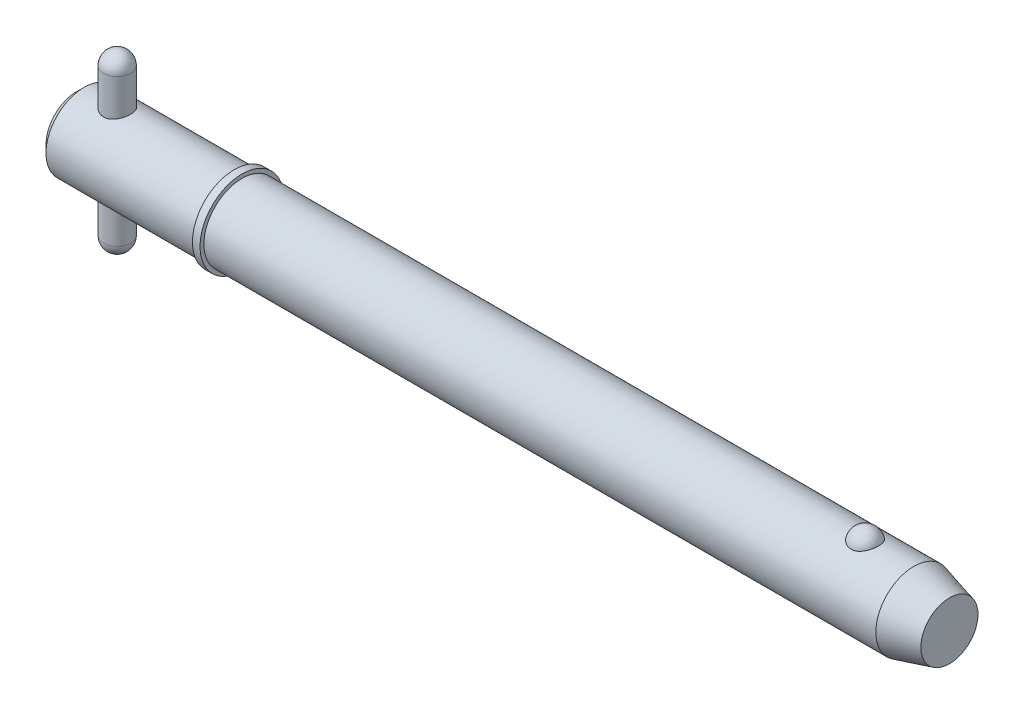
ISO-10303-21;
HEADER;
FILE_DESCRIPTION(('STEP AP214'),'2;1');
FILE_NAME('part.step','',(''),(''),'','','');
FILE_SCHEMA(('AUTOMOTIVE_DESIGN { 1 0 10303 214 1 1 1 1 }'));
ENDSEC;
DATA;
#1=APPLICATION_CONTEXT('core data for automotive mechanical design processes');
#2=APPLICATION_PROTOCOL_DEFINITION('international standard','automotive_design',2000,#1);
#3=PRODUCT_CONTEXT('',#1,'mechanical');
#4=PRODUCT('Part','Part','',(#3));
#5=PRODUCT_RELATED_PRODUCT_CATEGORY('part','',(#4));
#6=PRODUCT_DEFINITION_FORMATION('','',#4);
#7=PRODUCT_DEFINITION_CONTEXT('part definition',#1,'design');
#8=PRODUCT_DEFINITION('design','',#6,#7);
#9=PRODUCT_DEFINITION_SHAPE('','',#8);
#10=(LENGTH_UNIT() NAMED_UNIT(*) SI_UNIT(.MILLI.,.METRE.));
#11=(NAMED_UNIT(*) PLANE_ANGLE_UNIT() SI_UNIT($,.RADIAN.));
#12=(NAMED_UNIT(*) SI_UNIT($,.STERADIAN.) SOLID_ANGLE_UNIT());
#13=UNCERTAINTY_MEASURE_WITH_UNIT(LENGTH_MEASURE(1.E-05),#10,'distance_accuracy_value','');
#14=(GEOMETRIC_REPRESENTATION_CONTEXT(3) GLOBAL_UNCERTAINTY_ASSIGNED_CONTEXT((#13)) GLOBAL_UNIT_ASSIGNED_CONTEXT((#10,
#11,#12)) REPRESENTATION_CONTEXT('',''));
#15=CARTESIAN_POINT('',(0.,0.,0.));
#16=DIRECTION('',(0.,0.,1.));
#17=DIRECTION('',(1.,0.,0.));
#18=AXIS2_PLACEMENT_3D('',#15,#16,#17);
#19=CARTESIAN_POINT('',(5.94,12.7,0.));
#20=DIRECTION('',(0.,-1.,0.));
#21=DIRECTION('',(0.,0.,-1.));
#22=AXIS2_PLACEMENT_3D('',#19,#20,#21);
#23=CYLINDRICAL_SURFACE('',#22,1.98);
#24=CARTESIAN_POINT('',(5.94,-10.72,0.));
#25=DIRECTION('',(0.,-1.,0.));
#26=DIRECTION('',(0.,0.,-1.));
#27=AXIS2_PLACEMENT_3D('',#24,#25,#26);
#28=CIRCLE('',#27,1.98);
#29=CARTESIAN_POINT('',(5.94,-10.72,-1.98));
#30=VERTEX_POINT('',#29);
#31=EDGE_CURVE('P0_E10',#30,#30,#28,.F.);
#32=ORIENTED_EDGE('',*,*,#31,.T.);
#33=EDGE_LOOP('',(#32));
#34=FACE_BOUND('',#33,.T.);
#35=CARTESIAN_POINT('',(5.94,10.72,0.));
#36=DIRECTION('',(0.,-1.,0.));
#37=DIRECTION('',(0.,0.,-1.));
#38=AXIS2_PLACEMENT_3D('',#35,#36,#37);
#39=CIRCLE('',#38,1.98);
#40=CARTESIAN_POINT('',(5.94,10.72,-1.98));
#41=VERTEX_POINT('',#40);
#42=EDGE_CURVE('P0_E21',#41,#41,#39,.T.);
#43=ORIENTED_EDGE('',*,*,#42,.T.);
#44=EDGE_LOOP('',(#43));
#45=FACE_BOUND('',#44,.T.);
#46=ADVANCED_FACE('P0_F14',(#34,#45),#23,.T.);
#47=CARTESIAN_POINT('',(5.94,-10.72,0.));
#48=DIRECTION('',(0.,0.,1.));
#49=DIRECTION('',(1.,0.,0.));
#50=AXIS2_PLACEMENT_3D('',#47,#48,#49);
#51=SPHERICAL_SURFACE('',#50,1.98);
#52=CARTESIAN_POINT('',(5.94,-10.72,0.));
#53=DIRECTION('',(0.,-1.,0.));
#54=DIRECTION('',(0.,0.,-1.));
#55=AXIS2_PLACEMENT_3D('',#52,#53,#54);
#56=SPHERICAL_SURFACE('',#55,1.98);
#57=ORIENTED_EDGE('',*,*,#31,.F.);
#58=EDGE_LOOP('',(#57));
#59=FACE_BOUND('',#58,.T.);
#60=ADVANCED_FACE('P0_F29',(#59),#56,.T.);
#61=CARTESIAN_POINT('',(5.94,10.72,0.));
#62=DIRECTION('',(0.,0.,1.));
#63=DIRECTION('',(1.,0.,0.));
#64=AXIS2_PLACEMENT_3D('',#61,#62,#63);
#65=SPHERICAL_SURFACE('',#64,1.98);
#66=CARTESIAN_POINT('',(5.94,10.72,0.));
#67=DIRECTION('',(0.,-1.,0.));
#68=DIRECTION('',(0.,0.,-1.));
#69=AXIS2_PLACEMENT_3D('',#66,#67,#68);
#70=SPHERICAL_SURFACE('',#69,1.98);
#71=ORIENTED_EDGE('',*,*,#42,.F.);
#72=EDGE_LOOP('',(#71));
#73=FACE_BOUND('',#72,.T.);
#74=ADVANCED_FACE('P0_F16',(#73),#70,.T.);
#75=CLOSED_SHELL('',(#46,#60,#74));
#76=MANIFOLD_SOLID_BREP('P0_B1',#75);
#77=CARTESIAN_POINT('',(0.,0.,0.));
#78=DIRECTION('',(1.,0.,0.));
#79=DIRECTION('',(0.,0.,-1.));
#80=AXIS2_PLACEMENT_3D('',#77,#78,#79);
#81=CYLINDRICAL_SURFACE('',#80,5.555);
#82=CARTESIAN_POINT('',(122.117114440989,0.,0.));
#83=DIRECTION('',(1.,0.,0.));
#84=DIRECTION('',(0.,0.,-1.));
#85=AXIS2_PLACEMENT_3D('',#82,#83,#84);
#86=CIRCLE('',#85,5.555);
#87=CARTESIAN_POINT('',(122.117114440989,0.,-5.555));
#88=VERTEX_POINT('',#87);
#89=EDGE_CURVE('P1_E81',#88,#88,#86,.T.);
#90=ORIENTED_EDGE('',*,*,#89,.F.);
#91=EDGE_LOOP('',(#90));
#92=FACE_BOUND('',#91,.T.);
#93=CARTESIAN_POINT('',(24.13,0.,0.));
#94=DIRECTION('',(1.,0.,0.));
#95=DIRECTION('',(0.,0.,-1.));
#96=AXIS2_PLACEMENT_3D('',#93,#94,#95);
#97=CIRCLE('',#96,5.555);
#98=CARTESIAN_POINT('',(24.13,0.,-5.555));
#99=VERTEX_POINT('',#98);
#100=EDGE_CURVE('P1_E85',#99,#99,#97,.T.);
#101=ORIENTED_EDGE('',*,*,#100,.T.);
#102=EDGE_LOOP('',(#101));
#103=FACE_BOUND('',#102,.T.);
#104=CARTESIAN_POINT('',(114.998626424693,5.16741224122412,2.03859650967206));
#105=CARTESIAN_POINT('',(114.892949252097,5.16740893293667,2.03859990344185));
#106=CARTESIAN_POINT('',(114.78729894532,5.17079470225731,2.03008306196));
#107=CARTESIAN_POINT('',(114.579141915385,5.18392795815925,1.99630721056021));
#108=CARTESIAN_POINT('',(114.476634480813,5.19367399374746,1.97105201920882));
#109=CARTESIAN_POINT('',(114.277771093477,5.21839168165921,1.90463997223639));
#110=CARTESIAN_POINT('',(114.181406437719,5.23335573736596,1.86350622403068));
#111=CARTESIAN_POINT('',(113.997080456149,5.26688076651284,1.76652592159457));
#112=CARTESIAN_POINT('',(113.909120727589,5.28544242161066,1.71067657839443));
#113=CARTESIAN_POINT('',(113.741265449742,5.32479845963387,1.58399959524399));
#114=CARTESIAN_POINT('',(113.66166564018,5.34564089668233,1.51279545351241));
#115=CARTESIAN_POINT('',(113.51512901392,5.38697258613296,1.3582858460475));
#116=CARTESIAN_POINT('',(113.448194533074,5.40746177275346,1.27497815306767));
#117=CARTESIAN_POINT('',(113.32561039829,5.44694508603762,1.09440293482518));
#118=CARTESIAN_POINT('',(113.270598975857,5.46583143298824,0.996677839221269));
#119=CARTESIAN_POINT('',(113.176937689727,5.49908030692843,0.792961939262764));
#120=CARTESIAN_POINT('',(113.138289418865,5.513442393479,0.686970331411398));
#121=CARTESIAN_POINT('',(113.077680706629,5.536358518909,0.468019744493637));
#122=CARTESIAN_POINT('',(113.055972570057,5.54482455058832,0.354981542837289));
#123=CARTESIAN_POINT('',(113.030636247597,5.55473324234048,0.126595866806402));
#124=CARTESIAN_POINT('',(113.027007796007,5.55617600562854,0.0112484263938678));
#125=CARTESIAN_POINT('',(113.037881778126,5.55189984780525,-0.218011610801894));
#126=CARTESIAN_POINT('',(113.052315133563,5.54620821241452,-0.331928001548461));
#127=CARTESIAN_POINT('',(113.098903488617,5.52828920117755,-0.555544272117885));
#128=CARTESIAN_POINT('',(113.131058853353,5.51606169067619,-0.665244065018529));
#129=CARTESIAN_POINT('',(113.212488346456,5.48630779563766,-0.877469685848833));
#130=CARTESIAN_POINT('',(113.261781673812,5.4687754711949,-0.979987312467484));
#131=CARTESIAN_POINT('',(113.376478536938,5.43024700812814,-1.17486975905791));
#132=CARTESIAN_POINT('',(113.441883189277,5.40925062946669,-1.26723387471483));
#133=CARTESIAN_POINT('',(113.587571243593,5.36600927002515,-1.43940133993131));
#134=CARTESIAN_POINT('',(113.667885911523,5.34376173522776,-1.51917763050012));
#135=CARTESIAN_POINT('',(113.841452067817,5.30057971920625,-1.66360338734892));
#136=CARTESIAN_POINT('',(113.934702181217,5.27964509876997,-1.72825445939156));
#137=CARTESIAN_POINT('',(114.129393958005,5.24205250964,-1.83909478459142));
#138=CARTESIAN_POINT('',(114.230590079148,5.22530519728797,-1.88568407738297));
#139=CARTESIAN_POINT('',(114.440155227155,5.1975091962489,-1.96100802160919));
#140=CARTESIAN_POINT('',(114.548521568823,5.1864583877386,-1.98974931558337));
#141=CARTESIAN_POINT('',(114.763498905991,5.17184410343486,-2.02742262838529));
#142=CARTESIAN_POINT('',(114.869925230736,5.1679328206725,-2.03727608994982));
#143=CARTESIAN_POINT('',(115.082992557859,5.16698995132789,-2.03966777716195));
#144=CARTESIAN_POINT('',(115.189633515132,5.16995704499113,-2.03220932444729));
#145=CARTESIAN_POINT('',(115.396773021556,5.18222383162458,-2.00071170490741));
#146=CARTESIAN_POINT('',(115.497359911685,5.19133213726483,-1.97717337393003));
#147=CARTESIAN_POINT('',(115.693014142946,5.21467637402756,-1.91475248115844));
#148=CARTESIAN_POINT('',(115.788081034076,5.22891272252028,-1.8758686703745));
#149=CARTESIAN_POINT('',(115.972371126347,5.26137066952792,-1.7828271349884));
#150=CARTESIAN_POINT('',(116.061419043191,5.27967329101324,-1.72835124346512));
#151=CARTESIAN_POINT('',(116.229288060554,5.3181741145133,-1.6059748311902));
#152=CARTESIAN_POINT('',(116.308106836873,5.33837274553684,-1.53807126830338));
#153=CARTESIAN_POINT('',(116.457515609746,5.37968287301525,-1.38688970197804));
#154=CARTESIAN_POINT('',(116.527505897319,5.40079011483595,-1.30301744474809));
#155=CARTESIAN_POINT('',(116.653012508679,5.44074401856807,-1.12458170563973));
#156=CARTESIAN_POINT('',(116.708526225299,5.45959027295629,-1.03001630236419));
#157=CARTESIAN_POINT('',(116.805550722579,5.49369849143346,-0.829439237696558));
#158=CARTESIAN_POINT('',(116.846548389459,5.50882422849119,-0.723155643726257));
#159=CARTESIAN_POINT('',(116.911125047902,5.53310911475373,-0.504772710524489));
#160=CARTESIAN_POINT('',(116.934703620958,5.54226812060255,-0.392673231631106));
#161=CARTESIAN_POINT('',(116.964013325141,5.55370358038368,-0.165459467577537));
#162=CARTESIAN_POINT('',(116.969688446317,5.55595843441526,-0.0503368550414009));
#163=CARTESIAN_POINT('',(116.962916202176,5.55329317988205,0.179288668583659));
#164=CARTESIAN_POINT('',(116.950469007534,5.54837313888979,0.293791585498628));
#165=CARTESIAN_POINT('',(116.907779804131,5.53189037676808,0.518526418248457));
#166=CARTESIAN_POINT('',(116.877598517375,5.5203503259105,0.628771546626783));
#167=CARTESIAN_POINT('',(116.800096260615,5.49182453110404,0.842318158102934));
#168=CARTESIAN_POINT('',(116.752774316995,5.47483847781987,0.945619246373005));
#169=CARTESIAN_POINT('',(116.641720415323,5.43710633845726,1.14281571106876));
#170=CARTESIAN_POINT('',(116.577921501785,5.41634501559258,1.23667048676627));
#171=CARTESIAN_POINT('',(116.435357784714,5.37334572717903,1.41185243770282));
#172=CARTESIAN_POINT('',(116.35659323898,5.35110778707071,1.4931798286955));
#173=CARTESIAN_POINT('',(116.186423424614,5.30779474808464,1.64049162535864));
#174=CARTESIAN_POINT('',(116.09510026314,5.28671324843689,1.70656877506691));
#175=CARTESIAN_POINT('',(115.901739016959,5.24804852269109,1.82201372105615));
#176=CARTESIAN_POINT('',(115.799700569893,5.23046541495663,1.87138095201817));
#177=CARTESIAN_POINT('',(115.583618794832,5.20042692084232,1.95335298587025));
#178=CARTESIAN_POINT('',(115.469260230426,5.18820192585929,1.98521734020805));
#179=CARTESIAN_POINT('',(115.236130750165,5.17169804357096,2.02783294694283));
#180=CARTESIAN_POINT('',(115.117361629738,5.16741595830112,2.03859269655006));
#181=CARTESIAN_POINT('',(114.998626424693,5.16741224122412,2.03859650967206));
#182=B_SPLINE_CURVE_WITH_KNOTS('',3,(#104,#105,#106,#107,#108,#109,#110,#111,#112,#113,#114,
#115,#116,#117,#118,#119,#120,#121,#122,#123,#124,#125,#126,#127,#128,#129,#130,#131,#132,#133,
#134,#135,#136,#137,#138,#139,#140,#141,#142,#143,#144,#145,#146,#147,#148,#149,#150,#151,#152,
#153,#154,#155,#156,#157,#158,#159,#160,#161,#162,#163,#164,#165,#166,#167,#168,#169,#170,#171,
#172,#173,#174,#175,#176,#177,#178,#179,#180,#181),.UNSPECIFIED.,.T.,.F.,(4,2,2,2,2,2,2,2,2,2,2,
2,2,2,2,2,2,2,2,2,2,2,2,2,2,2,2,2,2,2,2,2,2,2,2,2,2,2,4),(0.,0.316595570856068,
0.633118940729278,0.949183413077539,1.26530783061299,1.59030762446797,1.91536729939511,
2.25495824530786,2.5945822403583,2.93917283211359,3.28375835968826,3.62703002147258,
3.97030875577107,4.31397329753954,4.65766166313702,5.0020790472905,5.34645984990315,
5.68270547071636,6.01882587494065,6.33808403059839,6.65728093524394,6.96696376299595,
7.27667180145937,7.59321535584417,7.90983070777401,8.24210387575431,8.57443684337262,
8.91755896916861,9.26068933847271,9.60489211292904,9.94909164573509,10.2921194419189,
10.6351667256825,10.9796305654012,11.3240884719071,11.6663928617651,12.0087088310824,
12.3645679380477,12.7202837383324),.UNSPECIFIED.);
#183=CARTESIAN_POINT('',(114.998626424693,5.16741224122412,2.03859650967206));
#184=VERTEX_POINT('',#183);
#185=EDGE_CURVE('P1_E35',#184,#184,#182,.T.);
#186=ORIENTED_EDGE('',*,*,#185,.T.);
#187=EDGE_LOOP('',(#186));
#188=FACE_BOUND('',#187,.T.);
#189=ADVANCED_FACE('P1_F13',(#92,#103,#188),#81,.T.);
#190=CARTESIAN_POINT('',(0.,0.,0.));
#191=DIRECTION('',(-1.,0.,0.));
#192=DIRECTION('',(0.,0.,1.));
#193=AXIS2_PLACEMENT_3D('',#190,#191,#192);
#194=PLANE('',#193);
#195=CARTESIAN_POINT('',(0.,0.,0.));
#196=DIRECTION('',(1.,0.,0.));
#197=DIRECTION('',(0.,0.,-1.));
#198=AXIS2_PLACEMENT_3D('',#195,#196,#197);
#199=CIRCLE('',#198,4.444);
#200=CARTESIAN_POINT('',(0.,0.,-4.444));
#201=VERTEX_POINT('',#200);
#202=EDGE_CURVE('P1_E9',#201,#201,#199,.T.);
#203=ORIENTED_EDGE('',*,*,#202,.F.);
#204=EDGE_LOOP('',(#203));
#205=FACE_BOUND('',#204,.T.);
#206=ADVANCED_FACE('P1_F15',(#205),#194,.T.);
#207=CARTESIAN_POINT('',(1.111,0.,0.));
#208=DIRECTION('',(1.,0.,0.));
#209=DIRECTION('',(0.,0.,-1.));
#210=AXIS2_PLACEMENT_3D('',#207,#208,#209);
#211=CONICAL_SURFACE('',#210,5.555,0.78539816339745);
#212=ORIENTED_EDGE('',*,*,#202,.T.);
#213=EDGE_LOOP('',(#212));
#214=FACE_BOUND('',#213,.T.);
#215=CARTESIAN_POINT('',(1.111,0.,0.));
#216=DIRECTION('',(1.,0.,0.));
#217=DIRECTION('',(0.,0.,-1.));
#218=AXIS2_PLACEMENT_3D('',#215,#216,#217);
#219=CIRCLE('',#218,5.555);
#220=CARTESIAN_POINT('',(1.111,0.,-5.555));
#221=VERTEX_POINT('',#220);
#222=EDGE_CURVE('P1_E26',#221,#221,#219,.T.);
#223=ORIENTED_EDGE('',*,*,#222,.F.);
#224=EDGE_LOOP('',(#223));
#225=FACE_BOUND('',#224,.T.);
#226=ADVANCED_FACE('P1_F77',(#214,#225),#211,.T.);
#227=CARTESIAN_POINT('',(0.,0.,0.));
#228=DIRECTION('',(1.,0.,0.));
#229=DIRECTION('',(0.,0.,-1.));
#230=AXIS2_PLACEMENT_3D('',#227,#228,#229);
#231=CYLINDRICAL_SURFACE('',#230,5.555);
#232=CARTESIAN_POINT('',(5.94,-5.19014691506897,1.98));
#233=CARTESIAN_POINT('',(5.83264687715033,-5.19014494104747,1.98000226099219));
#234=CARTESIAN_POINT('',(5.7253094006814,-5.19351395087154,1.97123988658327));
#235=CARTESIAN_POINT('',(5.51384517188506,-5.20654291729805,1.93656219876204));
#236=CARTESIAN_POINT('',(5.40971858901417,-5.21620320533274,1.91064598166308));
#237=CARTESIAN_POINT('',(5.20778082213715,-5.24058443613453,1.84271148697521));
#238=CARTESIAN_POINT('',(5.10995634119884,-5.25529427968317,1.80072850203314));
#239=CARTESIAN_POINT('',(4.92270352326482,-5.28810012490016,1.70197537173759));
#240=CARTESIAN_POINT('',(4.83327743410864,-5.3061970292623,1.64520128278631));
#241=CARTESIAN_POINT('',(4.66135184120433,-5.34464714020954,1.51575187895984));
#242=CARTESIAN_POINT('',(4.57928277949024,-5.36506222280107,1.44252311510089));
#243=CARTESIAN_POINT('',(4.42829115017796,-5.40532920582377,1.28342047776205));
#244=CARTESIAN_POINT('',(4.35937105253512,-5.42518099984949,1.19754423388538));
#245=CARTESIAN_POINT('',(4.23461605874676,-5.46281133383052,1.01237205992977));
#246=CARTESIAN_POINT('',(4.17924129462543,-5.48050875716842,0.912748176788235));
#247=CARTESIAN_POINT('',(4.0862117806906,-5.51109938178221,0.70485824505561));
#248=CARTESIAN_POINT('',(4.0485515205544,-5.52399407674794,0.596594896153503));
#249=CARTESIAN_POINT('',(3.99350662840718,-5.54308759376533,0.379019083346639));
#250=CARTESIAN_POINT('',(3.97538263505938,-5.54952987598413,0.269915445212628));
#251=CARTESIAN_POINT('',(3.95756405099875,-5.55586205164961,0.0500378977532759));
#252=CARTESIAN_POINT('',(3.95786404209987,-5.55575387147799,-0.060735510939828));
#253=CARTESIAN_POINT('',(3.97643665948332,-5.54915684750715,-0.275539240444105));
#254=CARTESIAN_POINT('',(3.99390415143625,-5.54295384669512,-0.379649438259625));
#255=CARTESIAN_POINT('',(4.0449721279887,-5.52523170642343,-0.583350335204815));
#256=CARTESIAN_POINT('',(4.07857373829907,-5.51371219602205,-0.682940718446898));
#257=CARTESIAN_POINT('',(4.16137312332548,-5.4863099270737,-0.876423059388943));
#258=CARTESIAN_POINT('',(4.2107826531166,-5.47036834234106,-0.970215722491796));
#259=CARTESIAN_POINT('',(4.32361427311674,-5.43575653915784,-1.1484017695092));
#260=CARTESIAN_POINT('',(4.38704062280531,-5.41708549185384,-1.23279228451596));
#261=CARTESIAN_POINT('',(4.53006791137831,-5.37778429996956,-1.39454579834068));
#262=CARTESIAN_POINT('',(4.61035105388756,-5.35710277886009,-1.4712940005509));
#263=CARTESIAN_POINT('',(4.78279835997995,-5.31692766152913,-1.6104545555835));
#264=CARTESIAN_POINT('',(4.874964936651,-5.29743430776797,-1.67286398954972));
#265=CARTESIAN_POINT('',(5.07076688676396,-5.26153775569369,-1.78259698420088));
#266=CARTESIAN_POINT('',(5.17458163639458,-5.24519780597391,-1.8296227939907));
#267=CARTESIAN_POINT('',(5.38938990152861,-5.21818744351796,-1.90530278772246));
#268=CARTESIAN_POINT('',(5.50037985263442,-5.20751423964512,-1.93396601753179));
#269=CARTESIAN_POINT('',(5.72036376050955,-5.19369176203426,-1.97077654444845));
#270=CARTESIAN_POINT('',(5.82917370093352,-5.19018851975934,-1.97989015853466));
#271=CARTESIAN_POINT('',(6.04680100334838,-5.19010609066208,-1.98010779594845));
#272=CARTESIAN_POINT('',(6.15561835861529,-5.19352540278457,-1.97121572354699));
#273=CARTESIAN_POINT('',(6.36548036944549,-5.20654623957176,-1.93654727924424));
#274=CARTESIAN_POINT('',(6.46666051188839,-5.21588705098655,-1.91148218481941));
#275=CARTESIAN_POINT('',(6.66334537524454,-5.23939939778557,-1.84605494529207));
#276=CARTESIAN_POINT('',(6.75884899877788,-5.25357186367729,-1.8056898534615));
#277=CARTESIAN_POINT('',(6.94517989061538,-5.28576258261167,-1.70921153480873));
#278=CARTESIAN_POINT('',(7.03572661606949,-5.30389804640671,-1.65259670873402));
#279=CARTESIAN_POINT('',(7.20638087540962,-5.34176077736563,-1.52577523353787));
#280=CARTESIAN_POINT('',(7.28648490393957,-5.36148857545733,-1.45556404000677));
#281=CARTESIAN_POINT('',(7.43864697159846,-5.40165494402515,-1.2988614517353));
#282=CARTESIAN_POINT('',(7.50999887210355,-5.42207106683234,-1.21167640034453));
#283=CARTESIAN_POINT('',(7.63712639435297,-5.46023601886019,-1.026066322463));
#284=CARTESIAN_POINT('',(7.69290228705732,-5.47798489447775,-0.927641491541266));
#285=CARTESIAN_POINT('',(7.78684673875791,-5.50876590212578,-0.722633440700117));
#286=CARTESIAN_POINT('',(7.82510508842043,-5.52182201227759,-0.616095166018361));
#287=CARTESIAN_POINT('',(7.88297051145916,-5.54184206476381,-0.397530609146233));
#288=CARTESIAN_POINT('',(7.90258540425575,-5.5488085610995,-0.285506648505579));
#289=CARTESIAN_POINT('',(7.9218262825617,-5.55564472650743,-0.065566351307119));
#290=CARTESIAN_POINT('',(7.92245987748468,-5.55587212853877,0.0422515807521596));
#291=CARTESIAN_POINT('',(7.90626329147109,-5.55011340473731,0.256387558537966));
#292=CARTESIAN_POINT('',(7.88943488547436,-5.54412791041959,0.362705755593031));
#293=CARTESIAN_POINT('',(7.83948457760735,-5.52676548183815,0.568649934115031));
#294=CARTESIAN_POINT('',(7.8067003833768,-5.51550046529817,0.668367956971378));
#295=CARTESIAN_POINT('',(7.72609369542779,-5.48874437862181,0.860911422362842));
#296=CARTESIAN_POINT('',(7.67826838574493,-5.47325251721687,0.953735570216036));
#297=CARTESIAN_POINT('',(7.56675024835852,-5.43884382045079,1.13391068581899));
#298=CARTESIAN_POINT('',(7.50249968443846,-5.41981485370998,1.22089468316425));
#299=CARTESIAN_POINT('',(7.36086495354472,-5.38069275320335,1.38316665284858));
#300=CARTESIAN_POINT('',(7.28347630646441,-5.36059925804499,1.45845061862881));
#301=CARTESIAN_POINT('',(7.11347587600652,-5.32048380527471,1.59876646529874));
#302=CARTESIAN_POINT('',(7.02032386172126,-5.30050854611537,1.66315951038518));
#303=CARTESIAN_POINT('',(6.82388804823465,-5.26398994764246,1.77536801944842));
#304=CARTESIAN_POINT('',(6.7206049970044,-5.24744635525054,1.82318470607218));
#305=CARTESIAN_POINT('',(6.50639706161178,-5.21987969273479,1.90068230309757));
#306=CARTESIAN_POINT('',(6.3954529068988,-5.20887116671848,1.93031547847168));
#307=CARTESIAN_POINT('',(6.16966522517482,-5.19400760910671,1.96996824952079));
#308=CARTESIAN_POINT('',(6.05482366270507,-5.19014902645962,1.97999758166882));
#309=CARTESIAN_POINT('',(5.94,-5.19014691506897,1.98));
#310=B_SPLINE_CURVE_WITH_KNOTS('',3,(#232,#233,#234,#235,#236,#237,#238,#239,#240,#241,#242,
#243,#244,#245,#246,#247,#248,#249,#250,#251,#252,#253,#254,#255,#256,#257,#258,#259,#260,#261,
#262,#263,#264,#265,#266,#267,#268,#269,#270,#271,#272,#273,#274,#275,#276,#277,#278,#279,#280,
#281,#282,#283,#284,#285,#286,#287,#288,#289,#290,#291,#292,#293,#294,#295,#296,#297,#298,#299,
#300,#301,#302,#303,#304,#305,#306,#307,#308,#309),.UNSPECIFIED.,.T.,.F.,(4,2,2,2,2,2,2,2,2,2,2,
2,2,2,2,2,2,2,2,2,2,2,2,2,2,2,2,2,2,2,2,2,2,2,2,2,2,2,4),(0.,0.321632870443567,
0.643282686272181,0.964229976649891,1.28526292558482,1.61937087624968,1.9535415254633,
2.29784481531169,2.64204093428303,2.97269632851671,3.30325448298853,3.61901541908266,
3.93479838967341,4.25500220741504,4.57530346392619,4.91268648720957,5.25013812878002,
5.59378026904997,5.93725299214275,6.26331481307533,6.58930593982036,6.90185604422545,
7.21446637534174,7.53801472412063,7.86167140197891,8.20353561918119,8.54539388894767,
8.88547970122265,9.22542281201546,9.54728637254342,9.86911722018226,10.1844146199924,
10.4997710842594,10.827730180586,11.1558013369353,11.499115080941,11.8424034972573,
12.1865892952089,12.5306041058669),.UNSPECIFIED.);
#311=CARTESIAN_POINT('',(5.94,-5.19014691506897,1.98));
#312=VERTEX_POINT('',#311);
#313=EDGE_CURVE('P1_E17',#312,#312,#310,.T.);
#314=ORIENTED_EDGE('',*,*,#313,.F.);
#315=EDGE_LOOP('',(#314));
#316=FACE_BOUND('',#315,.T.);
#317=CARTESIAN_POINT('',(5.94,5.19014691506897,1.98));
#318=CARTESIAN_POINT('',(6.04735312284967,5.19014494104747,1.98000226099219));
#319=CARTESIAN_POINT('',(6.1546905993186,5.19351395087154,1.97123988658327));
#320=CARTESIAN_POINT('',(6.36615482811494,5.20654291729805,1.93656219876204));
#321=CARTESIAN_POINT('',(6.47028141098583,5.21620320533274,1.91064598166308));
#322=CARTESIAN_POINT('',(6.67221917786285,5.24058443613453,1.84271148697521));
#323=CARTESIAN_POINT('',(6.77004365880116,5.25529427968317,1.80072850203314));
#324=CARTESIAN_POINT('',(6.95729647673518,5.28810012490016,1.70197537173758));
#325=CARTESIAN_POINT('',(7.04672256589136,5.3061970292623,1.64520128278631));
#326=CARTESIAN_POINT('',(7.21864815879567,5.34464714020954,1.51575187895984));
#327=CARTESIAN_POINT('',(7.30071722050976,5.36506222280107,1.44252311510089));
#328=CARTESIAN_POINT('',(7.45170884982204,5.40532920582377,1.28342047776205));
#329=CARTESIAN_POINT('',(7.52062894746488,5.42518099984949,1.19754423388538));
#330=CARTESIAN_POINT('',(7.64538394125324,5.46281133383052,1.01237205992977));
#331=CARTESIAN_POINT('',(7.70075870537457,5.48050875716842,0.912748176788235));
#332=CARTESIAN_POINT('',(7.7937882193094,5.51109938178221,0.704858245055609));
#333=CARTESIAN_POINT('',(7.8314484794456,5.52399407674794,0.596594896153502));
#334=CARTESIAN_POINT('',(7.88649337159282,5.54308759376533,0.379019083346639));
#335=CARTESIAN_POINT('',(7.90461736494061,5.54952987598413,0.269915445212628));
#336=CARTESIAN_POINT('',(7.92243594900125,5.55586205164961,0.0500378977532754));
#337=CARTESIAN_POINT('',(7.92213595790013,5.55575387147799,-0.0607355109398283));
#338=CARTESIAN_POINT('',(7.90356334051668,5.54915684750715,-0.275539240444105));
#339=CARTESIAN_POINT('',(7.88609584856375,5.54295384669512,-0.379649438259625));
#340=CARTESIAN_POINT('',(7.8350278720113,5.52523170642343,-0.583350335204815));
#341=CARTESIAN_POINT('',(7.80142626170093,5.51371219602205,-0.682940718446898));
#342=CARTESIAN_POINT('',(7.71862687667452,5.4863099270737,-0.876423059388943));
#343=CARTESIAN_POINT('',(7.6692173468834,5.47036834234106,-0.970215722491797));
#344=CARTESIAN_POINT('',(7.55638572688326,5.43575653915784,-1.1484017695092));
#345=CARTESIAN_POINT('',(7.49295937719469,5.41708549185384,-1.23279228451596));
#346=CARTESIAN_POINT('',(7.34993208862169,5.37778429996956,-1.39454579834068));
#347=CARTESIAN_POINT('',(7.26964894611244,5.35710277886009,-1.4712940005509));
#348=CARTESIAN_POINT('',(7.09720164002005,5.31692766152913,-1.6104545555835));
#349=CARTESIAN_POINT('',(7.00503506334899,5.29743430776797,-1.67286398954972));
#350=CARTESIAN_POINT('',(6.80923311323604,5.26153775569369,-1.78259698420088));
#351=CARTESIAN_POINT('',(6.70541836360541,5.24519780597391,-1.8296227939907));
#352=CARTESIAN_POINT('',(6.49061009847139,5.21818744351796,-1.90530278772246));
#353=CARTESIAN_POINT('',(6.37962014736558,5.20751423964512,-1.93396601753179));
#354=CARTESIAN_POINT('',(6.15963623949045,5.19369176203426,-1.97077654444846));
#355=CARTESIAN_POINT('',(6.05082629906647,5.19018851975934,-1.97989015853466));
#356=CARTESIAN_POINT('',(5.83319899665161,5.19010609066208,-1.98010779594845));
#357=CARTESIAN_POINT('',(5.7243816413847,5.19352540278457,-1.97121572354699));
#358=CARTESIAN_POINT('',(5.5145196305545,5.20654623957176,-1.93654727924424));
#359=CARTESIAN_POINT('',(5.4133394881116,5.21588705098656,-1.91148218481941));
#360=CARTESIAN_POINT('',(5.21665462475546,5.23939939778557,-1.84605494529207));
#361=CARTESIAN_POINT('',(5.12115100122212,5.25357186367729,-1.8056898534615));
#362=CARTESIAN_POINT('',(4.93482010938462,5.28576258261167,-1.70921153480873));
#363=CARTESIAN_POINT('',(4.84427338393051,5.30389804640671,-1.65259670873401));
#364=CARTESIAN_POINT('',(4.67361912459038,5.34176077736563,-1.52577523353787));
#365=CARTESIAN_POINT('',(4.59351509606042,5.36148857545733,-1.45556404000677));
#366=CARTESIAN_POINT('',(4.44135302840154,5.40165494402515,-1.2988614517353));
#367=CARTESIAN_POINT('',(4.37000112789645,5.42207106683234,-1.21167640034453));
#368=CARTESIAN_POINT('',(4.24287360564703,5.46023601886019,-1.026066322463));
#369=CARTESIAN_POINT('',(4.18709771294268,5.47798489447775,-0.927641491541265));
#370=CARTESIAN_POINT('',(4.09315326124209,5.50876590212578,-0.722633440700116));
#371=CARTESIAN_POINT('',(4.05489491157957,5.52182201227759,-0.61609516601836));
#372=CARTESIAN_POINT('',(3.99702948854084,5.54184206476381,-0.397530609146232));
#373=CARTESIAN_POINT('',(3.97741459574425,5.5488085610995,-0.285506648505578));
#374=CARTESIAN_POINT('',(3.9581737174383,5.55564472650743,-0.0655663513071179));
#375=CARTESIAN_POINT('',(3.95754012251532,5.55587212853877,0.0422515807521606));
#376=CARTESIAN_POINT('',(3.97373670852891,5.55011340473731,0.256387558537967));
#377=CARTESIAN_POINT('',(3.99056511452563,5.54412791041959,0.362705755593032));
#378=CARTESIAN_POINT('',(4.04051542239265,5.52676548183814,0.568649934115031));
#379=CARTESIAN_POINT('',(4.07329961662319,5.51550046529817,0.668367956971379));
#380=CARTESIAN_POINT('',(4.15390630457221,5.48874437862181,0.860911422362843));
#381=CARTESIAN_POINT('',(4.20173161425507,5.47325251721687,0.953735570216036));
#382=CARTESIAN_POINT('',(4.31324975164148,5.43884382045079,1.13391068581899));
#383=CARTESIAN_POINT('',(4.37750031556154,5.41981485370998,1.22089468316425));
#384=CARTESIAN_POINT('',(4.51913504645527,5.38069275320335,1.38316665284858));
#385=CARTESIAN_POINT('',(4.59652369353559,5.36059925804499,1.45845061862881));
#386=CARTESIAN_POINT('',(4.76652412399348,5.32048380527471,1.59876646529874));
#387=CARTESIAN_POINT('',(4.85967613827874,5.30050854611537,1.66315951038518));
#388=CARTESIAN_POINT('',(5.05611195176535,5.26398994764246,1.77536801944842));
#389=CARTESIAN_POINT('',(5.1593950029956,5.24744635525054,1.82318470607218));
#390=CARTESIAN_POINT('',(5.37360293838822,5.21987969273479,1.90068230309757));
#391=CARTESIAN_POINT('',(5.4845470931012,5.20887116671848,1.93031547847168));
#392=CARTESIAN_POINT('',(5.71033477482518,5.19400760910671,1.96996824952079));
#393=CARTESIAN_POINT('',(5.82517633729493,5.19014902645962,1.97999758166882));
#394=CARTESIAN_POINT('',(5.94,5.19014691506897,1.98));
#395=B_SPLINE_CURVE_WITH_KNOTS('',3,(#317,#318,#319,#320,#321,#322,#323,#324,#325,#326,#327,
#328,#329,#330,#331,#332,#333,#334,#335,#336,#337,#338,#339,#340,#341,#342,#343,#344,#345,#346,
#347,#348,#349,#350,#351,#352,#353,#354,#355,#356,#357,#358,#359,#360,#361,#362,#363,#364,#365,
#366,#367,#368,#369,#370,#371,#372,#373,#374,#375,#376,#377,#378,#379,#380,#381,#382,#383,#384,
#385,#386,#387,#388,#389,#390,#391,#392,#393,#394),.UNSPECIFIED.,.T.,.F.,(4,2,2,2,2,2,2,2,2,2,2,
2,2,2,2,2,2,2,2,2,2,2,2,2,2,2,2,2,2,2,2,2,2,2,2,2,2,2,4),(0.,0.321632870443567,
0.643282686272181,0.964229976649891,1.28526292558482,1.61937087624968,1.9535415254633,
2.29784481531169,2.64204093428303,2.97269632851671,3.30325448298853,3.61901541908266,
3.93479838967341,4.25500220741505,4.57530346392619,4.91268648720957,5.25013812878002,
5.59378026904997,5.93725299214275,6.26331481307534,6.58930593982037,6.90185604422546,
7.21446637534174,7.53801472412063,7.86167140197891,8.20353561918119,8.54539388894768,
8.88547970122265,9.22542281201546,9.54728637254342,9.86911722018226,10.1844146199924,
10.4997710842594,10.827730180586,11.1558013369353,11.499115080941,11.8424034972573,
12.1865892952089,12.5306041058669),.UNSPECIFIED.);
#396=CARTESIAN_POINT('',(5.94,5.19014691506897,1.98));
#397=VERTEX_POINT('',#396);
#398=EDGE_CURVE('P1_E43',#397,#397,#395,.T.);
#399=ORIENTED_EDGE('',*,*,#398,.F.);
#400=EDGE_LOOP('',(#399));
#401=FACE_BOUND('',#400,.T.);
#402=ORIENTED_EDGE('',*,*,#222,.T.);
#403=EDGE_LOOP('',(#402));
#404=FACE_BOUND('',#403,.T.);
#405=CARTESIAN_POINT('',(23.019,0.,0.));
#406=DIRECTION('',(1.,0.,0.));
#407=DIRECTION('',(0.,0.,-1.));
#408=AXIS2_PLACEMENT_3D('',#405,#406,#407);
#409=CIRCLE('',#408,5.555);
#410=CARTESIAN_POINT('',(23.019,0.,-5.555));
#411=VERTEX_POINT('',#410);
#412=EDGE_CURVE('P1_E31',#411,#411,#409,.T.);
#413=ORIENTED_EDGE('',*,*,#412,.F.);
#414=EDGE_LOOP('',(#413));
#415=FACE_BOUND('',#414,.T.);
#416=ADVANCED_FACE('P1_F103',(#316,#401,#404,#415),#231,.T.);
#417=CARTESIAN_POINT('',(23.019,5.555,0.));
#418=DIRECTION('',(-1.,0.,0.));
#419=DIRECTION('',(0.,0.,1.));
#420=AXIS2_PLACEMENT_3D('',#417,#418,#419);
#421=PLANE('',#420);
#422=ORIENTED_EDGE('',*,*,#412,.T.);
#423=EDGE_LOOP('',(#422));
#424=FACE_BOUND('',#423,.T.);
#425=CARTESIAN_POINT('',(23.019,0.,0.));
#426=DIRECTION('',(1.,0.,0.));
#427=DIRECTION('',(0.,0.,-1.));
#428=AXIS2_PLACEMENT_3D('',#425,#426,#427);
#429=CIRCLE('',#428,6.1105);
#430=CARTESIAN_POINT('',(23.019,0.,-6.1105));
#431=VERTEX_POINT('',#430);
#432=EDGE_CURVE('P1_E91',#431,#431,#429,.T.);
#433=ORIENTED_EDGE('',*,*,#432,.F.);
#434=EDGE_LOOP('',(#433));
#435=FACE_BOUND('',#434,.T.);
#436=ADVANCED_FACE('P1_F100',(#424,#435),#421,.T.);
#437=CARTESIAN_POINT('',(0.,0.,0.));
#438=DIRECTION('',(1.,0.,0.));
#439=DIRECTION('',(0.,0.,-1.));
#440=AXIS2_PLACEMENT_3D('',#437,#438,#439);
#441=CYLINDRICAL_SURFACE('',#440,6.1105);
#442=ORIENTED_EDGE('',*,*,#432,.T.);
#443=EDGE_LOOP('',(#442));
#444=FACE_BOUND('',#443,.T.);
#445=CARTESIAN_POINT('',(24.13,0.,0.));
#446=DIRECTION('',(1.,0.,0.));
#447=DIRECTION('',(0.,0.,-1.));
#448=AXIS2_PLACEMENT_3D('',#445,#446,#447);
#449=CIRCLE('',#448,6.1105);
#450=CARTESIAN_POINT('',(24.13,0.,-6.1105));
#451=VERTEX_POINT('',#450);
#452=EDGE_CURVE('P1_E88',#451,#451,#449,.T.);
#453=ORIENTED_EDGE('',*,*,#452,.F.);
#454=EDGE_LOOP('',(#453));
#455=FACE_BOUND('',#454,.T.);
#456=ADVANCED_FACE('P1_F68',(#444,#455),#441,.T.);
#457=CARTESIAN_POINT('',(24.13,6.1105,0.));
#458=DIRECTION('',(1.,0.,0.));
#459=DIRECTION('',(0.,0.,-1.));
#460=AXIS2_PLACEMENT_3D('',#457,#458,#459);
#461=PLANE('',#460);
#462=ORIENTED_EDGE('',*,*,#452,.T.);
#463=EDGE_LOOP('',(#462));
#464=FACE_BOUND('',#463,.T.);
#465=ORIENTED_EDGE('',*,*,#100,.F.);
#466=EDGE_LOOP('',(#465));
#467=FACE_BOUND('',#466,.T.);
#468=ADVANCED_FACE('P1_F62',(#464,#467),#461,.T.);
#469=CARTESIAN_POINT('',(127.3,0.,0.));
#470=DIRECTION('',(-1.,0.,0.));
#471=DIRECTION('',(0.,0.,1.));
#472=AXIS2_PLACEMENT_3D('',#469,#470,#471);
#473=CONICAL_SURFACE('',#472,4.16625000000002,0.26179938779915);
#474=ORIENTED_EDGE('',*,*,#89,.T.);
#475=EDGE_LOOP('',(#474));
#476=FACE_BOUND('',#475,.T.);
#477=CARTESIAN_POINT('',(127.3,0.,0.));
#478=DIRECTION('',(1.,0.,0.));
#479=DIRECTION('',(0.,0.,-1.));
#480=AXIS2_PLACEMENT_3D('',#477,#478,#479);
#481=CIRCLE('',#480,4.16625000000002);
#482=CARTESIAN_POINT('',(127.3,0.,-4.16625000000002));
#483=VERTEX_POINT('',#482);
#484=EDGE_CURVE('P1_E42',#483,#483,#481,.T.);
#485=ORIENTED_EDGE('',*,*,#484,.F.);
#486=EDGE_LOOP('',(#485));
#487=FACE_BOUND('',#486,.T.);
#488=ADVANCED_FACE('P1_F59',(#476,#487),#473,.T.);
#489=CARTESIAN_POINT('',(127.3,4.16625000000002,0.));
#490=DIRECTION('',(1.,0.,0.));
#491=DIRECTION('',(0.,0.,-1.));
#492=AXIS2_PLACEMENT_3D('',#489,#490,#491);
#493=PLANE('',#492);
#494=ORIENTED_EDGE('',*,*,#484,.T.);
#495=EDGE_LOOP('',(#494));
#496=FACE_BOUND('',#495,.T.);
#497=ADVANCED_FACE('P1_F55',(#496),#493,.T.);
#498=CARTESIAN_POINT('',(114.998626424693,4.9995,0.));
#499=DIRECTION('',(-1.,0.,0.));
#500=DIRECTION('',(0.,1.,0.));
#501=AXIS2_PLACEMENT_3D('',#498,#499,#500);
#502=SPHERICAL_SURFACE('',#501,2.04550000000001);
#503=ORIENTED_EDGE('',*,*,#185,.F.);
#504=EDGE_LOOP('',(#503));
#505=FACE_BOUND('',#504,.T.);
#506=ADVANCED_FACE('P1_F50',(#505),#502,.T.);
#507=CARTESIAN_POINT('',(5.94,-6.1105,0.));
#508=DIRECTION('',(0.,1.,0.));
#509=DIRECTION('',(0.,0.,1.));
#510=AXIS2_PLACEMENT_3D('',#507,#508,#509);
#511=CYLINDRICAL_SURFACE('',#510,1.98);
#512=ORIENTED_EDGE('',*,*,#313,.T.);
#513=EDGE_LOOP('',(#512));
#514=FACE_BOUND('',#513,.T.);
#515=ORIENTED_EDGE('',*,*,#398,.T.);
#516=EDGE_LOOP('',(#515));
#517=FACE_BOUND('',#516,.T.);
#518=ADVANCED_FACE('P1_F54',(#514,#517),#511,.F.);
#519=CLOSED_SHELL('',(#189,#206,#226,#416,#436,#456,#468,#488,#497,#506,#518));
#520=MANIFOLD_SOLID_BREP('P1_B1',#519);
#521=ADVANCED_BREP_SHAPE_REPRESENTATION('',(#18,#76,#520),#14);
#522=SHAPE_DEFINITION_REPRESENTATION(#9,#521);
ENDSEC;
END-ISO-10303-21;
